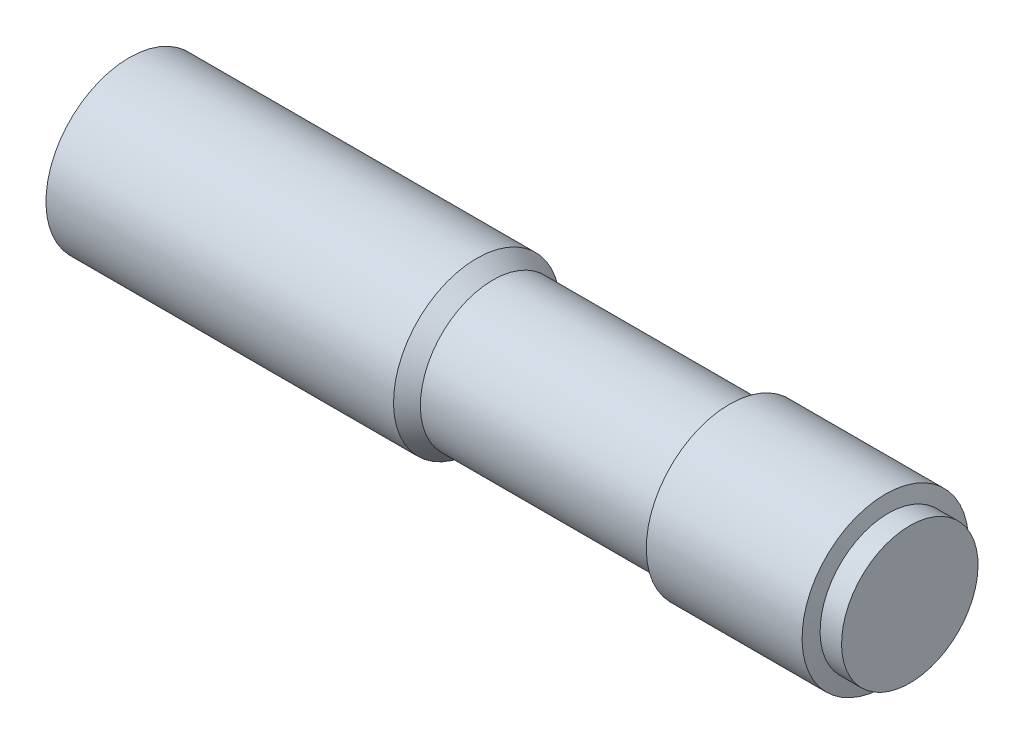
from build123d import *


with BuildPart() as part:
    # Sketch1 → Revolve1 (revolve)
    with BuildSketch(Plane.XY):
        Polygon((-72.965638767, 5.225436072), (-72.965638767, 20.725436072), (-8.265638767, 20.725436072), (-5.272907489, 18.725436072), (37.441629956, 18.725436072), (38.778201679, 20.725436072), (67.778201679, 20.725436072), (68.33494055, 17.925436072), (72.33494055, 17.925436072), (72.33494055, 5.225436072), align=None)
    revolve(axis=Axis((72.33494055, 5.225436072, 0), (-1, 0, 0)))


solid = part.part
